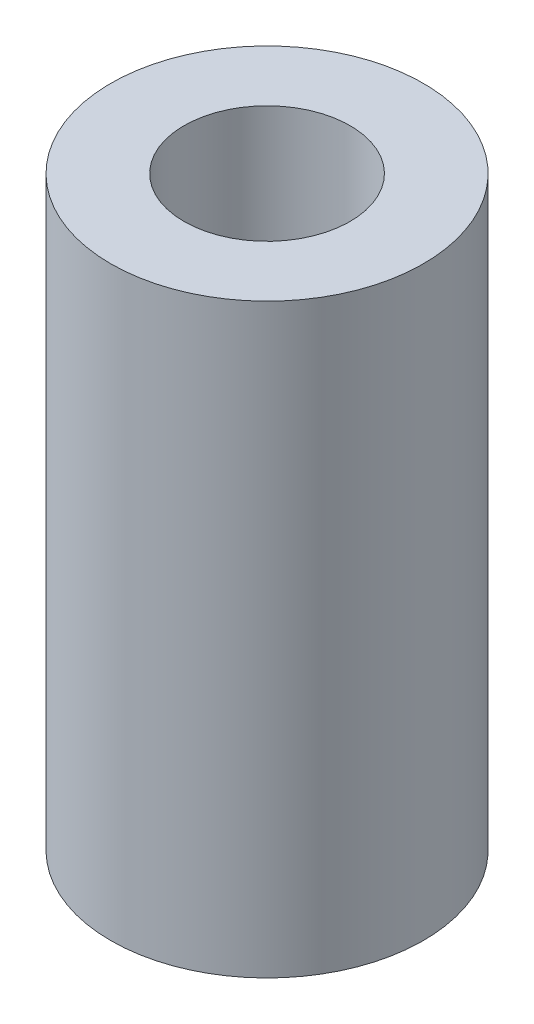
ISO-10303-21;
HEADER;
FILE_DESCRIPTION(('STEP AP214'),'2;1');
FILE_NAME('part.step','',(''),(''),'','','');
FILE_SCHEMA(('AUTOMOTIVE_DESIGN { 1 0 10303 214 1 1 1 1 }'));
ENDSEC;
DATA;
#1=APPLICATION_CONTEXT('core data for automotive mechanical design processes');
#2=APPLICATION_PROTOCOL_DEFINITION('international standard','automotive_design',2000,#1);
#3=PRODUCT_CONTEXT('',#1,'mechanical');
#4=PRODUCT('Part','Part','',(#3));
#5=PRODUCT_RELATED_PRODUCT_CATEGORY('part','',(#4));
#6=PRODUCT_DEFINITION_FORMATION('','',#4);
#7=PRODUCT_DEFINITION_CONTEXT('part definition',#1,'design');
#8=PRODUCT_DEFINITION('design','',#6,#7);
#9=PRODUCT_DEFINITION_SHAPE('','',#8);
#10=(LENGTH_UNIT() NAMED_UNIT(*) SI_UNIT(.MILLI.,.METRE.));
#11=(NAMED_UNIT(*) PLANE_ANGLE_UNIT() SI_UNIT($,.RADIAN.));
#12=(NAMED_UNIT(*) SI_UNIT($,.STERADIAN.) SOLID_ANGLE_UNIT());
#13=UNCERTAINTY_MEASURE_WITH_UNIT(LENGTH_MEASURE(1.E-05),#10,'distance_accuracy_value','');
#14=(GEOMETRIC_REPRESENTATION_CONTEXT(3) GLOBAL_UNCERTAINTY_ASSIGNED_CONTEXT((#13)) GLOBAL_UNIT_ASSIGNED_CONTEXT((#10,
#11,#12)) REPRESENTATION_CONTEXT('',''));
#15=CARTESIAN_POINT('',(0.,0.,0.));
#16=DIRECTION('',(0.,0.,1.));
#17=DIRECTION('',(1.,0.,0.));
#18=AXIS2_PLACEMENT_3D('',#15,#16,#17);
#19=CARTESIAN_POINT('',(0.,7.5,0.));
#20=DIRECTION('',(0.,1.,0.));
#21=DIRECTION('',(0.,0.,1.));
#22=AXIS2_PLACEMENT_3D('',#19,#20,#21);
#23=PLANE('',#22);
#24=CARTESIAN_POINT('',(0.,7.5,0.));
#25=DIRECTION('',(0.,1.,0.));
#26=DIRECTION('',(0.,0.,1.));
#27=AXIS2_PLACEMENT_3D('',#24,#25,#26);
#28=CIRCLE('',#27,4.);
#29=CARTESIAN_POINT('',(0.,7.5,4.));
#30=VERTEX_POINT('',#29);
#31=EDGE_CURVE('E10',#30,#30,#28,.T.);
#32=ORIENTED_EDGE('',*,*,#31,.T.);
#33=EDGE_LOOP('',(#32));
#34=FACE_BOUND('',#33,.T.);
#35=CARTESIAN_POINT('',(0.,7.5,0.));
#36=DIRECTION('',(0.,1.,0.));
#37=DIRECTION('',(0.,0.,1.));
#38=AXIS2_PLACEMENT_3D('',#35,#36,#37);
#39=CIRCLE('',#38,2.125);
#40=CARTESIAN_POINT('',(0.,7.5,2.125));
#41=VERTEX_POINT('',#40);
#42=EDGE_CURVE('E43',#41,#41,#39,.T.);
#43=ORIENTED_EDGE('',*,*,#42,.F.);
#44=EDGE_LOOP('',(#43));
#45=FACE_BOUND('',#44,.T.);
#46=ADVANCED_FACE('F32',(#34,#45),#23,.T.);
#47=CARTESIAN_POINT('',(0.,-7.5,0.));
#48=DIRECTION('',(0.,1.,0.));
#49=DIRECTION('',(0.,0.,1.));
#50=AXIS2_PLACEMENT_3D('',#47,#48,#49);
#51=PLANE('',#50);
#52=CARTESIAN_POINT('',(0.,-7.5,0.));
#53=DIRECTION('',(0.,1.,0.));
#54=DIRECTION('',(0.,0.,1.));
#55=AXIS2_PLACEMENT_3D('',#52,#53,#54);
#56=CIRCLE('',#55,4.);
#57=CARTESIAN_POINT('',(0.,-7.5,4.));
#58=VERTEX_POINT('',#57);
#59=EDGE_CURVE('E36',#58,#58,#56,.T.);
#60=ORIENTED_EDGE('',*,*,#59,.F.);
#61=EDGE_LOOP('',(#60));
#62=FACE_BOUND('',#61,.T.);
#63=CARTESIAN_POINT('',(0.,-7.5,0.));
#64=DIRECTION('',(0.,1.,0.));
#65=DIRECTION('',(0.,0.,1.));
#66=AXIS2_PLACEMENT_3D('',#63,#64,#65);
#67=CIRCLE('',#66,2.125);
#68=CARTESIAN_POINT('',(0.,-7.5,2.125));
#69=VERTEX_POINT('',#68);
#70=EDGE_CURVE('E45',#69,#69,#67,.T.);
#71=ORIENTED_EDGE('',*,*,#70,.T.);
#72=EDGE_LOOP('',(#71));
#73=FACE_BOUND('',#72,.T.);
#74=ADVANCED_FACE('F55',(#62,#73),#51,.F.);
#75=CARTESIAN_POINT('',(0.,7.5,0.));
#76=DIRECTION('',(0.,-1.,0.));
#77=DIRECTION('',(0.,0.,-1.));
#78=AXIS2_PLACEMENT_3D('',#75,#76,#77);
#79=CYLINDRICAL_SURFACE('',#78,4.);
#80=ORIENTED_EDGE('',*,*,#31,.F.);
#81=EDGE_LOOP('',(#80));
#82=FACE_BOUND('',#81,.T.);
#83=ORIENTED_EDGE('',*,*,#59,.T.);
#84=EDGE_LOOP('',(#83));
#85=FACE_BOUND('',#84,.T.);
#86=ADVANCED_FACE('F34',(#82,#85),#79,.T.);
#87=CARTESIAN_POINT('',(0.,7.5,0.));
#88=DIRECTION('',(0.,-1.,0.));
#89=DIRECTION('',(0.,0.,-1.));
#90=AXIS2_PLACEMENT_3D('',#87,#88,#89);
#91=CYLINDRICAL_SURFACE('',#90,2.125);
#92=ORIENTED_EDGE('',*,*,#42,.T.);
#93=EDGE_LOOP('',(#92));
#94=FACE_BOUND('',#93,.T.);
#95=ORIENTED_EDGE('',*,*,#70,.F.);
#96=EDGE_LOOP('',(#95));
#97=FACE_BOUND('',#96,.T.);
#98=ADVANCED_FACE('F51',(#94,#97),#91,.F.);
#99=CLOSED_SHELL('',(#46,#74,#86,#98));
#100=MANIFOLD_SOLID_BREP('B2',#99);
#101=ADVANCED_BREP_SHAPE_REPRESENTATION('',(#18,#100),#14);
#102=SHAPE_DEFINITION_REPRESENTATION(#9,#101);
ENDSEC;
END-ISO-10303-21;
